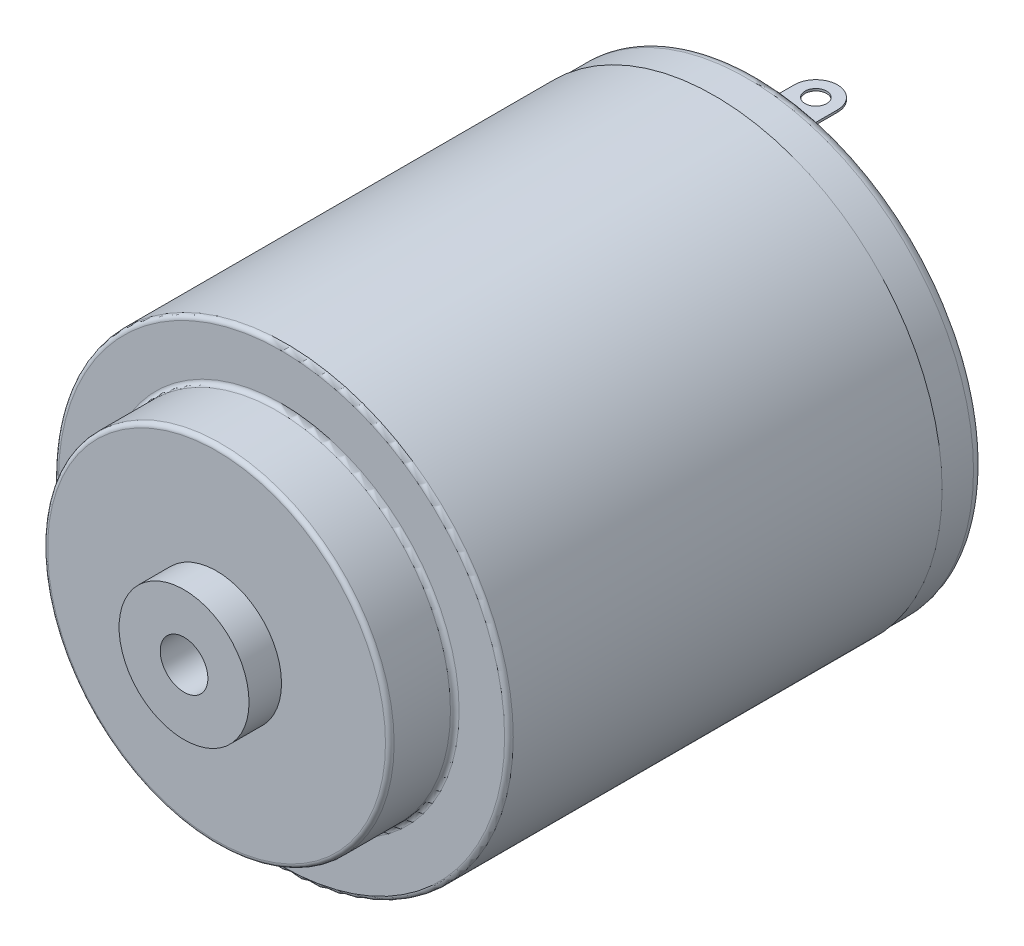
from build123d import *

# Parameters (mm, degrees)
ESQUISSE1_R             = 10.5
EXTRUSION1_DEPTH        = 20
ESQUISSE2_R             = 8
EXTRUSION2_DEPTH        = 3
ESQUISSE3_R             = 3
EXTRUSION3_DEPTH        = 1.5
CONG_1_R                = 0.2
ESQUISSE5_R             = 10.45
EXTRUSION5_DEPTH        = 2
CONG_5_R                = 0.5
ENL_V_MAT_EXTRU_1_DEPTH = 0.5
EXTRUSION7_START        = 2
EXTRUSION7_DEPTH        = 2
ESQUISSE8_R             = 1.5
ENL_V_MAT_EXTRU_2_DEPTH = 1
EXTRUSION9_DEPTH        = 0.1
ESQUISSE11_R            = 0.5
ENL_V_MAT_EXTRU_3_DEPTH = 33.503230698
EXTRUSION10_DEPTH       = 0.1
ESQUISSE13_R            = 0.5
ENL_V_MAT_EXTRU_4_DEPTH = 33.446109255
ESQUISSE4_R             = 1.1
ENL_V_MAT_EXTRU_6_DEPTH = 34.627172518


with BuildPart() as part:
    # Esquisse1 → Extrusion1 (new body)
    with BuildSketch(Plane.XY):
        Circle(ESQUISSE1_R)
    extrude(amount=EXTRUSION1_DEPTH)

    # Esquisse2 → Extrusion2 (add)
    with BuildSketch(Plane.XY.offset(20)):
        Circle(ESQUISSE2_R)
    extrude(amount=EXTRUSION2_DEPTH)

    # Esquisse3 → Extrusion3 (add)
    with BuildSketch(Plane.XY.offset(23)):
        Circle(ESQUISSE3_R)
    extrude(amount=EXTRUSION3_DEPTH)

    # Cong_1
    cong_1_edges = [part.edges().sort_by_distance(p)[0] for p in [
        (-10.5, 0, 20),
        (-8, 0, 20),
        (-8, 0, 23),
    ]]
    fillet(cong_1_edges, radius=CONG_1_R)

    # Esquisse5 → Extrusion5 (add)
    with BuildSketch(Plane(origin=(0, 0, 0), x_dir=(-1, 0, 0), z_dir=(0, 0, -1))):
        with Locations(Location((0, 0, 0), (0, 0, 180))):
            Circle(ESQUISSE5_R)
    extrude(amount=EXTRUSION5_DEPTH)

    # Cong_5
    cong_5_edges = [part.edges().sort_by_distance(p)[0] for p in [
        (-10.45, 0, -2),
    ]]
    fillet(cong_5_edges, radius=CONG_5_R)

    # Esquisse6 → Enl_v. mat.-Extru.1 (cut)
    with BuildSketch(Plane(origin=(0, 0, -2), x_dir=(-1, 0, 0), z_dir=(0, 0, -1))):
        with BuildLine():
            Line((-1.75, 3.031088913), (-1.75, 6.259992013))
            ThreePointArc((-1.75, 6.259992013), (-6.5, 0), (-1.75, -6.259992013))
            Line((-1.75, -6.259992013), (-1.75, -3.031088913))
            ThreePointArc((-1.75, -3.031088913), (-3.5, 0), (-1.75, 3.031088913))
        make_face()
        with BuildLine():
            Line((1.75, 6.259992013), (1.75, 3.031088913))
            ThreePointArc((1.75, 3.031088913), (3.5, 0), (1.75, -3.031088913))
            Line((1.75, -3.031088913), (1.75, -6.259992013))
            ThreePointArc((1.75, -6.259992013), (6.5, 0), (1.75, 6.259992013))
        make_face()
    extrude(amount=-ENL_V_MAT_EXTRU_1_DEPTH, mode=Mode.SUBTRACT)

    # Esquisse7 → Extrusion7 (add)
    with BuildSketch(Plane(origin=(0, 0, -2), x_dir=(-1, 0, 0), z_dir=(0, 0, -1)).offset(EXTRUSION7_START)):
        with BuildLine():
            Line((-1.918163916, 2.306652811), (1.918163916, 2.306652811))
            ThreePointArc((1.918163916, 2.306652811), (0, -3), (-1.918163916, 2.306652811))
        make_face()
    extrude(amount=-EXTRUSION7_DEPTH)

    # Esquisse8 → Enl_v. mat.-Extru.2 (cut)
    with BuildSketch(Plane(origin=(0, 0, -4), x_dir=(-1, 0, 0), z_dir=(0, 0, -1))):
        Circle(ESQUISSE8_R)
    extrude(amount=-ENL_V_MAT_EXTRU_2_DEPTH, mode=Mode.SUBTRACT)

    # Esquisse10 → Extrusion9 (add)
    with BuildSketch(Plane(origin=(0, 8, 0), x_dir=(-1, 0, 0), z_dir=(0, 1, 0))):
        with BuildLine():
            Line((-1, -0.935861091), (1, -0.935861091))
            Line((1, -0.935861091), (1, -4.670958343))
            ThreePointArc((1, -4.670958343), (0, -5.670958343), (-1, -4.670958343))
            Line((-1, -4.670958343), (-1, -0.935861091))
        make_face()
    extrude(amount=EXTRUSION9_DEPTH)

    # Esquisse11 → Enl_v. mat.-Extru.3 (cut, through all)
    with BuildSketch(Plane(origin=(0, 8.1, 0), x_dir=(-1, 0, 0), z_dir=(0, 1, 0))):
        with Locations(Location((0, -4.670958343, 0), (0, 0, 90))):
            Circle(ESQUISSE11_R)
    extrude(amount=-ENL_V_MAT_EXTRU_3_DEPTH, mode=Mode.SUBTRACT)

    # Esquisse12 → Extrusion10 (add)
    with BuildSketch(Plane(origin=(0, -8, 0), x_dir=(-1, 0, 0), z_dir=(0, 1, 0))):
        with BuildLine():
            Line((1, -2), (-1, -2))
            Line((-1, -2), (-1, -4.670958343))
            ThreePointArc((-1, -4.670958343), (0, -5.670958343), (1, -4.670958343))
            Line((1, -4.670958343), (1, -2))
        make_face()
    extrude(amount=EXTRUSION10_DEPTH)

    # Esquisse13 → Enl_v. mat.-Extru.4 (cut, through all)
    with BuildSketch(Plane.XZ.offset(8)):
        with Locations(Location((0, -4.670958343, 0), (0, 0, 90))):
            Circle(ESQUISSE13_R)
    extrude(amount=-ENL_V_MAT_EXTRU_4_DEPTH, mode=Mode.SUBTRACT)

    # Esquisse4 → Enl_v. mat.-Extru.6 (cut, through all)
    with BuildSketch(Plane.XY.offset(24.5)):
        Circle(ESQUISSE4_R)
    extrude(amount=-ENL_V_MAT_EXTRU_6_DEPTH, mode=Mode.SUBTRACT)


solid = part.part
